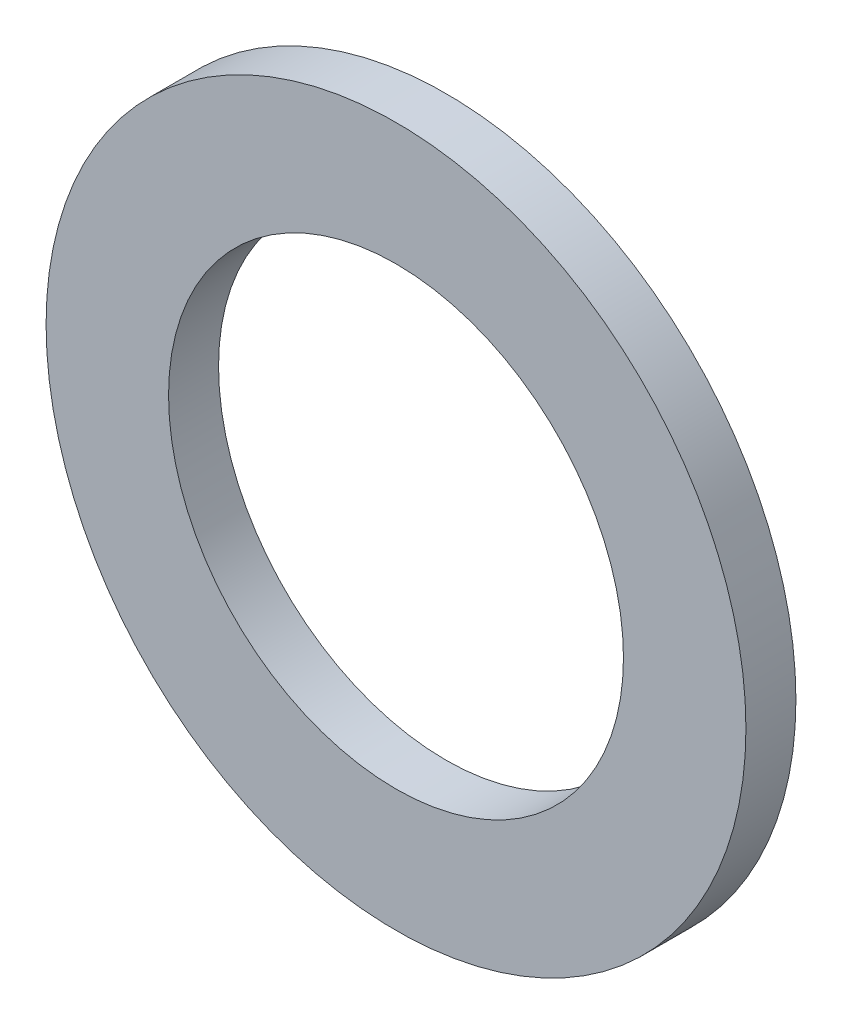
from build123d import *

# Parameters (mm, degrees)
ESQUISSE1_R      = 14
ESQUISSE1_R_2    = 9.1
EXTRUSION1_DEPTH = 2


with BuildPart() as part:
    # Esquisse1 → Extrusion1 (new body)
    with BuildSketch(Plane.XY):
        Circle(ESQUISSE1_R)
        Circle(ESQUISSE1_R_2, mode=Mode.SUBTRACT)
    extrude(amount=EXTRUSION1_DEPTH)


solid = part.part
